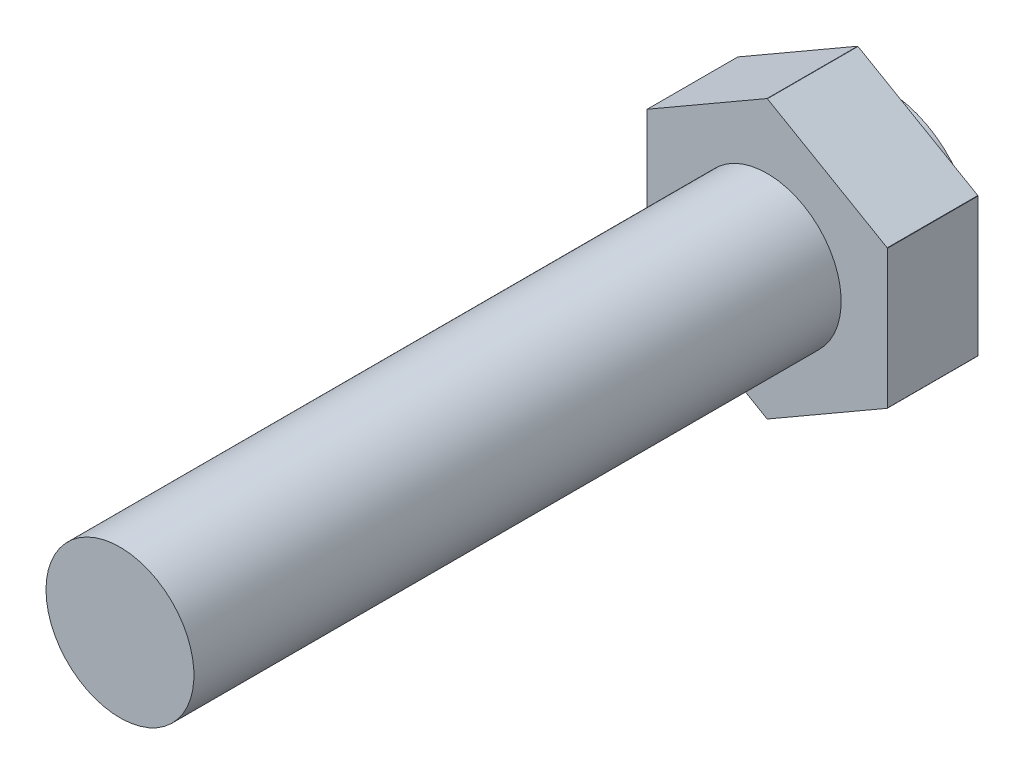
ISO-10303-21;
HEADER;
FILE_DESCRIPTION(('STEP AP214'),'2;1');
FILE_NAME('part.step','',(''),(''),'','','');
FILE_SCHEMA(('AUTOMOTIVE_DESIGN { 1 0 10303 214 1 1 1 1 }'));
ENDSEC;
DATA;
#1=APPLICATION_CONTEXT('core data for automotive mechanical design processes');
#2=APPLICATION_PROTOCOL_DEFINITION('international standard','automotive_design',2000,#1);
#3=PRODUCT_CONTEXT('',#1,'mechanical');
#4=PRODUCT('Part','Part','',(#3));
#5=PRODUCT_RELATED_PRODUCT_CATEGORY('part','',(#4));
#6=PRODUCT_DEFINITION_FORMATION('','',#4);
#7=PRODUCT_DEFINITION_CONTEXT('part definition',#1,'design');
#8=PRODUCT_DEFINITION('design','',#6,#7);
#9=PRODUCT_DEFINITION_SHAPE('','',#8);
#10=(LENGTH_UNIT() NAMED_UNIT(*) SI_UNIT(.MILLI.,.METRE.));
#11=(NAMED_UNIT(*) PLANE_ANGLE_UNIT() SI_UNIT($,.RADIAN.));
#12=(NAMED_UNIT(*) SI_UNIT($,.STERADIAN.) SOLID_ANGLE_UNIT());
#13=UNCERTAINTY_MEASURE_WITH_UNIT(LENGTH_MEASURE(1.E-05),#10,'distance_accuracy_value','');
#14=(GEOMETRIC_REPRESENTATION_CONTEXT(3) GLOBAL_UNCERTAINTY_ASSIGNED_CONTEXT((#13)) GLOBAL_UNIT_ASSIGNED_CONTEXT((#10,
#11,#12)) REPRESENTATION_CONTEXT('',''));
#15=CARTESIAN_POINT('',(0.,0.,0.));
#16=DIRECTION('',(0.,0.,1.));
#17=DIRECTION('',(1.,0.,0.));
#18=AXIS2_PLACEMENT_3D('',#15,#16,#17);
#19=CARTESIAN_POINT('',(-4.,0.,6.4));
#20=DIRECTION('',(0.,0.,-1.));
#21=DIRECTION('',(-1.,0.,0.));
#22=AXIS2_PLACEMENT_3D('',#19,#20,#21);
#23=PLANE('',#22);
#24=CARTESIAN_POINT('',(0.,0.,6.4));
#25=DIRECTION('',(0.,0.,-1.));
#26=DIRECTION('',(-1.,0.,0.));
#27=AXIS2_PLACEMENT_3D('',#24,#25,#26);
#28=CIRCLE('',#27,4.);
#29=CARTESIAN_POINT('',(-4.,0.,6.4));
#30=VERTEX_POINT('',#29);
#31=EDGE_CURVE('E131',#30,#30,#28,.T.);
#32=ORIENTED_EDGE('',*,*,#31,.T.);
#33=EDGE_LOOP('',(#32));
#34=FACE_BOUND('',#33,.T.);
#35=CARTESIAN_POINT('',(0.,0.,6.4));
#36=DIRECTION('',(0.,0.,-1.));
#37=DIRECTION('',(-1.,0.,0.));
#38=AXIS2_PLACEMENT_3D('',#35,#36,#37);
#39=CIRCLE('',#38,7.5);
#40=CARTESIAN_POINT('',(-0.00962965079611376,7.49999381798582,6.4));
#41=VERTEX_POINT('',#40);
#42=CARTESIAN_POINT('',(0.00962965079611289,7.49999381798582,6.4));
#43=VERTEX_POINT('',#42);
#44=EDGE_CURVE('E132',#41,#43,#39,.T.);
#45=ORIENTED_EDGE('',*,*,#44,.F.);
#46=DIRECTION('',(-0.866025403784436,-0.5,0.));
#47=VECTOR('',#46,1.);
#48=CARTESIAN_POINT('',(-6.25,3.89711431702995,6.4));
#49=LINE('',#48,#47);
#50=CARTESIAN_POINT('',(-6.49037034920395,3.75833643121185,6.4));
#51=VERTEX_POINT('',#50);
#52=EDGE_CURVE('E116',#41,#51,#49,.T.);
#53=ORIENTED_EDGE('',*,*,#52,.T.);
#54=CARTESIAN_POINT('',(-6.5,3.74165738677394,6.4));
#55=VERTEX_POINT('',#54);
#56=EDGE_CURVE('E128',#55,#51,#39,.T.);
#57=ORIENTED_EDGE('',*,*,#56,.F.);
#58=DIRECTION('',(0.,-1.,0.));
#59=VECTOR('',#58,1.);
#60=CARTESIAN_POINT('',(-6.5,0.,6.4));
#61=LINE('',#60,#59);
#62=CARTESIAN_POINT('',(-6.5,-3.74165738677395,6.4));
#63=VERTEX_POINT('',#62);
#64=EDGE_CURVE('E122',#55,#63,#61,.T.);
#65=ORIENTED_EDGE('',*,*,#64,.T.);
#66=CARTESIAN_POINT('',(-6.49037034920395,-3.75833643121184,6.4));
#67=VERTEX_POINT('',#66);
#68=EDGE_CURVE('E127',#67,#63,#39,.T.);
#69=ORIENTED_EDGE('',*,*,#68,.F.);
#70=DIRECTION('',(-0.866025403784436,0.5,0.));
#71=VECTOR('',#70,1.);
#72=CARTESIAN_POINT('',(-6.25,-3.89711431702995,6.4));
#73=LINE('',#72,#71);
#74=CARTESIAN_POINT('',(-0.00962965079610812,-7.49999381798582,6.4));
#75=VERTEX_POINT('',#74);
#76=EDGE_CURVE('E248',#75,#67,#73,.T.);
#77=ORIENTED_EDGE('',*,*,#76,.F.);
#78=CARTESIAN_POINT('',(0.00962965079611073,-7.49999381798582,6.4));
#79=VERTEX_POINT('',#78);
#80=EDGE_CURVE('E263',#79,#75,#39,.T.);
#81=ORIENTED_EDGE('',*,*,#80,.F.);
#82=DIRECTION('',(0.866025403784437,0.5,0.));
#83=VECTOR('',#82,1.);
#84=CARTESIAN_POINT('',(0.250000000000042,-7.36121593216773,6.4));
#85=LINE('',#84,#83);
#86=CARTESIAN_POINT('',(6.49037034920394,-3.75833643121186,6.4));
#87=VERTEX_POINT('',#86);
#88=EDGE_CURVE('E240',#79,#87,#85,.T.);
#89=ORIENTED_EDGE('',*,*,#88,.T.);
#90=CARTESIAN_POINT('',(6.5,-3.74165738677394,6.4));
#91=VERTEX_POINT('',#90);
#92=EDGE_CURVE('E265',#91,#87,#39,.T.);
#93=ORIENTED_EDGE('',*,*,#92,.F.);
#94=DIRECTION('',(0.,-1.,0.));
#95=VECTOR('',#94,1.);
#96=CARTESIAN_POINT('',(6.5,0.,6.4));
#97=LINE('',#96,#95);
#98=CARTESIAN_POINT('',(6.5,3.74165738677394,6.4));
#99=VERTEX_POINT('',#98);
#100=EDGE_CURVE('E233',#99,#91,#97,.T.);
#101=ORIENTED_EDGE('',*,*,#100,.F.);
#102=CARTESIAN_POINT('',(6.49037034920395,3.75833643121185,6.4));
#103=VERTEX_POINT('',#102);
#104=EDGE_CURVE('E270',#103,#99,#39,.T.);
#105=ORIENTED_EDGE('',*,*,#104,.F.);
#106=DIRECTION('',(0.866025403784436,-0.5,0.));
#107=VECTOR('',#106,1.);
#108=CARTESIAN_POINT('',(0.250000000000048,7.36121593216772,6.4));
#109=LINE('',#108,#107);
#110=EDGE_CURVE('E226',#43,#103,#109,.T.);
#111=ORIENTED_EDGE('',*,*,#110,.F.);
#112=EDGE_LOOP('',(#45,#53,#57,#65,#69,#77,#81,#89,#93,#101,#105,#111));
#113=FACE_BOUND('',#112,.T.);
#114=ADVANCED_FACE('F15',(#34,#113),#23,.F.);
#115=CARTESIAN_POINT('',(0.,0.,-28.6));
#116=DIRECTION('',(0.,0.,-1.));
#117=DIRECTION('',(-1.,0.,0.));
#118=AXIS2_PLACEMENT_3D('',#115,#116,#117);
#119=CYLINDRICAL_SURFACE('',#118,7.5);
#120=DIRECTION('',(0.,0.,-1.));
#121=VECTOR('',#120,1.);
#122=CARTESIAN_POINT('',(-6.49037034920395,3.75833643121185,-28.6));
#123=LINE('',#122,#121);
#124=CARTESIAN_POINT('',(-6.49037034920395,3.75833643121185,1.5));
#125=VERTEX_POINT('',#124);
#126=EDGE_CURVE('E37',#51,#125,#123,.T.);
#127=ORIENTED_EDGE('',*,*,#126,.T.);
#128=CARTESIAN_POINT('',(0.,0.,1.5));
#129=DIRECTION('',(0.,0.,1.));
#130=DIRECTION('',(1.,0.,0.));
#131=AXIS2_PLACEMENT_3D('',#128,#129,#130);
#132=CIRCLE('',#131,7.5);
#133=CARTESIAN_POINT('',(-6.5,3.74165738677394,1.5));
#134=VERTEX_POINT('',#133);
#135=EDGE_CURVE('E31',#125,#134,#132,.T.);
#136=ORIENTED_EDGE('',*,*,#135,.T.);
#137=DIRECTION('',(0.,0.,-1.));
#138=VECTOR('',#137,1.);
#139=CARTESIAN_POINT('',(-6.5,3.74165738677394,-28.6));
#140=LINE('',#139,#138);
#141=EDGE_CURVE('E253',#134,#55,#140,.F.);
#142=ORIENTED_EDGE('',*,*,#141,.T.);
#143=ORIENTED_EDGE('',*,*,#56,.T.);
#144=EDGE_LOOP('',(#127,#136,#142,#143));
#145=FACE_BOUND('',#144,.T.);
#146=ADVANCED_FACE('F152',(#145),#119,.T.);
#147=DIRECTION('',(0.,0.,-1.));
#148=VECTOR('',#147,1.);
#149=CARTESIAN_POINT('',(-6.5,-3.74165738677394,-28.6));
#150=LINE('',#149,#148);
#151=CARTESIAN_POINT('',(-6.5,-3.74165738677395,1.5));
#152=VERTEX_POINT('',#151);
#153=EDGE_CURVE('E118',#63,#152,#150,.T.);
#154=ORIENTED_EDGE('',*,*,#153,.T.);
#155=CARTESIAN_POINT('',(0.,0.,1.5));
#156=DIRECTION('',(0.,0.,1.));
#157=DIRECTION('',(1.,0.,0.));
#158=AXIS2_PLACEMENT_3D('',#155,#156,#157);
#159=CIRCLE('',#158,7.5);
#160=CARTESIAN_POINT('',(-6.49037034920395,-3.75833643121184,1.5));
#161=VERTEX_POINT('',#160);
#162=EDGE_CURVE('E209',#152,#161,#159,.T.);
#163=ORIENTED_EDGE('',*,*,#162,.T.);
#164=DIRECTION('',(0.,0.,-1.));
#165=VECTOR('',#164,1.);
#166=CARTESIAN_POINT('',(-6.49037034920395,-3.75833643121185,-28.6));
#167=LINE('',#166,#165);
#168=EDGE_CURVE('E250',#67,#161,#167,.T.);
#169=ORIENTED_EDGE('',*,*,#168,.F.);
#170=ORIENTED_EDGE('',*,*,#68,.T.);
#171=EDGE_LOOP('',(#154,#163,#169,#170));
#172=FACE_BOUND('',#171,.T.);
#173=ADVANCED_FACE('F159',(#172),#119,.T.);
#174=DIRECTION('',(0.,0.,-1.));
#175=VECTOR('',#174,1.);
#176=CARTESIAN_POINT('',(0.00962965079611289,7.49999381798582,-28.6));
#177=LINE('',#176,#175);
#178=CARTESIAN_POINT('',(0.00962965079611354,7.49999381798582,1.5));
#179=VERTEX_POINT('',#178);
#180=EDGE_CURVE('E112',#179,#43,#177,.F.);
#181=ORIENTED_EDGE('',*,*,#180,.F.);
#182=CARTESIAN_POINT('',(0.,0.,1.5));
#183=DIRECTION('',(0.,0.,1.));
#184=DIRECTION('',(1.,0.,0.));
#185=AXIS2_PLACEMENT_3D('',#182,#183,#184);
#186=CIRCLE('',#185,7.5);
#187=CARTESIAN_POINT('',(-0.00962965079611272,7.49999381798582,1.5));
#188=VERTEX_POINT('',#187);
#189=EDGE_CURVE('E104',#179,#188,#186,.T.);
#190=ORIENTED_EDGE('',*,*,#189,.T.);
#191=DIRECTION('',(0.,0.,-1.));
#192=VECTOR('',#191,1.);
#193=CARTESIAN_POINT('',(-0.00962965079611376,7.49999381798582,-28.6));
#194=LINE('',#193,#192);
#195=EDGE_CURVE('E111',#188,#41,#194,.F.);
#196=ORIENTED_EDGE('',*,*,#195,.T.);
#197=ORIENTED_EDGE('',*,*,#44,.T.);
#198=EDGE_LOOP('',(#181,#190,#196,#197));
#199=FACE_BOUND('',#198,.T.);
#200=ADVANCED_FACE('F109',(#199),#119,.T.);
#201=DIRECTION('',(0.,0.,-1.));
#202=VECTOR('',#201,1.);
#203=CARTESIAN_POINT('',(-0.00962965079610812,-7.49999381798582,-28.6));
#204=LINE('',#203,#202);
#205=CARTESIAN_POINT('',(-0.00962965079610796,-7.49999381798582,1.5));
#206=VERTEX_POINT('',#205);
#207=EDGE_CURVE('E246',#206,#75,#204,.F.);
#208=ORIENTED_EDGE('',*,*,#207,.F.);
#209=CARTESIAN_POINT('',(0.,0.,1.5));
#210=DIRECTION('',(0.,0.,1.));
#211=DIRECTION('',(1.,0.,0.));
#212=AXIS2_PLACEMENT_3D('',#209,#210,#211);
#213=CIRCLE('',#212,7.5);
#214=CARTESIAN_POINT('',(0.00962965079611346,-7.49999381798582,1.5));
#215=VERTEX_POINT('',#214);
#216=EDGE_CURVE('E219',#206,#215,#213,.T.);
#217=ORIENTED_EDGE('',*,*,#216,.T.);
#218=DIRECTION('',(0.,0.,-1.));
#219=VECTOR('',#218,1.);
#220=CARTESIAN_POINT('',(0.00962965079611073,-7.49999381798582,-28.6));
#221=LINE('',#220,#219);
#222=EDGE_CURVE('E238',#215,#79,#221,.F.);
#223=ORIENTED_EDGE('',*,*,#222,.T.);
#224=ORIENTED_EDGE('',*,*,#80,.T.);
#225=EDGE_LOOP('',(#208,#217,#223,#224));
#226=FACE_BOUND('',#225,.T.);
#227=ADVANCED_FACE('F284',(#226),#119,.T.);
#228=DIRECTION('',(0.,0.,-1.));
#229=VECTOR('',#228,1.);
#230=CARTESIAN_POINT('',(6.49037034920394,-3.75833643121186,-28.6));
#231=LINE('',#230,#229);
#232=CARTESIAN_POINT('',(6.49037034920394,-3.75833643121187,1.5));
#233=VERTEX_POINT('',#232);
#234=EDGE_CURVE('E243',#87,#233,#231,.T.);
#235=ORIENTED_EDGE('',*,*,#234,.T.);
#236=CARTESIAN_POINT('',(0.,0.,1.5));
#237=DIRECTION('',(0.,0.,1.));
#238=DIRECTION('',(1.,0.,0.));
#239=AXIS2_PLACEMENT_3D('',#236,#237,#238);
#240=CIRCLE('',#239,7.5);
#241=CARTESIAN_POINT('',(6.5,-3.74165738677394,1.5));
#242=VERTEX_POINT('',#241);
#243=EDGE_CURVE('E216',#233,#242,#240,.T.);
#244=ORIENTED_EDGE('',*,*,#243,.T.);
#245=DIRECTION('',(0.,0.,-1.));
#246=VECTOR('',#245,1.);
#247=CARTESIAN_POINT('',(6.5,-3.74165738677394,-28.6));
#248=LINE('',#247,#246);
#249=EDGE_CURVE('E235',#91,#242,#248,.T.);
#250=ORIENTED_EDGE('',*,*,#249,.F.);
#251=ORIENTED_EDGE('',*,*,#92,.T.);
#252=EDGE_LOOP('',(#235,#244,#250,#251));
#253=FACE_BOUND('',#252,.T.);
#254=ADVANCED_FACE('F149',(#253),#119,.T.);
#255=DIRECTION('',(0.,0.,-1.));
#256=VECTOR('',#255,1.);
#257=CARTESIAN_POINT('',(6.5,3.74165738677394,-28.6));
#258=LINE('',#257,#256);
#259=CARTESIAN_POINT('',(6.5,3.74165738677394,1.5));
#260=VERTEX_POINT('',#259);
#261=EDGE_CURVE('E231',#260,#99,#258,.F.);
#262=ORIENTED_EDGE('',*,*,#261,.F.);
#263=CARTESIAN_POINT('',(0.,0.,1.5));
#264=DIRECTION('',(0.,0.,1.));
#265=DIRECTION('',(1.,0.,0.));
#266=AXIS2_PLACEMENT_3D('',#263,#264,#265);
#267=CIRCLE('',#266,7.5);
#268=CARTESIAN_POINT('',(6.49037034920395,3.75833643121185,1.5));
#269=VERTEX_POINT('',#268);
#270=EDGE_CURVE('E206',#260,#269,#267,.T.);
#271=ORIENTED_EDGE('',*,*,#270,.T.);
#272=DIRECTION('',(0.,0.,-1.));
#273=VECTOR('',#272,1.);
#274=CARTESIAN_POINT('',(6.49037034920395,3.75833643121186,-28.6));
#275=LINE('',#274,#273);
#276=EDGE_CURVE('E228',#103,#269,#275,.T.);
#277=ORIENTED_EDGE('',*,*,#276,.F.);
#278=ORIENTED_EDGE('',*,*,#104,.T.);
#279=EDGE_LOOP('',(#262,#271,#277,#278));
#280=FACE_BOUND('',#279,.T.);
#281=ADVANCED_FACE('F141',(#280),#119,.T.);
#282=CARTESIAN_POINT('',(0.,0.,41.4));
#283=DIRECTION('',(0.,0.,-1.));
#284=DIRECTION('',(-1.,0.,0.));
#285=AXIS2_PLACEMENT_3D('',#282,#283,#284);
#286=PLANE('',#285);
#287=CARTESIAN_POINT('',(0.,0.,41.4));
#288=DIRECTION('',(0.,0.,-1.));
#289=DIRECTION('',(-1.,0.,0.));
#290=AXIS2_PLACEMENT_3D('',#287,#288,#289);
#291=CIRCLE('',#290,4.);
#292=CARTESIAN_POINT('',(-4.,0.,41.4));
#293=VERTEX_POINT('',#292);
#294=EDGE_CURVE('E24',#293,#293,#291,.T.);
#295=ORIENTED_EDGE('',*,*,#294,.F.);
#296=EDGE_LOOP('',(#295));
#297=FACE_BOUND('',#296,.T.);
#298=ADVANCED_FACE('F17',(#297),#286,.F.);
#299=CARTESIAN_POINT('',(0.,0.,-28.6));
#300=DIRECTION('',(0.,0.,-1.));
#301=DIRECTION('',(-1.,0.,0.));
#302=AXIS2_PLACEMENT_3D('',#299,#300,#301);
#303=CYLINDRICAL_SURFACE('',#302,4.);
#304=ORIENTED_EDGE('',*,*,#31,.F.);
#305=EDGE_LOOP('',(#304));
#306=FACE_BOUND('',#305,.T.);
#307=ORIENTED_EDGE('',*,*,#294,.T.);
#308=EDGE_LOOP('',(#307));
#309=FACE_BOUND('',#308,.T.);
#310=ADVANCED_FACE('F138',(#306,#309),#303,.T.);
#311=CARTESIAN_POINT('',(0.,7.50555349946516,10.));
#312=DIRECTION('',(0.5,0.866025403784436,0.));
#313=DIRECTION('',(0.866025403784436,-0.5,0.));
#314=AXIS2_PLACEMENT_3D('',#311,#312,#313);
#315=PLANE('',#314);
#316=DIRECTION('',(0.866025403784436,-0.5,0.));
#317=VECTOR('',#316,1.);
#318=CARTESIAN_POINT('',(0.,7.50555349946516,1.5));
#319=LINE('',#318,#317);
#320=EDGE_CURVE('E204',#179,#269,#319,.T.);
#321=ORIENTED_EDGE('',*,*,#320,.F.);
#322=ORIENTED_EDGE('',*,*,#180,.T.);
#323=ORIENTED_EDGE('',*,*,#110,.T.);
#324=ORIENTED_EDGE('',*,*,#276,.T.);
#325=EDGE_LOOP('',(#321,#322,#323,#324));
#326=FACE_BOUND('',#325,.T.);
#327=ADVANCED_FACE('F147',(#326),#315,.T.);
#328=CARTESIAN_POINT('',(6.5,3.75277674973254,10.));
#329=DIRECTION('',(1.,0.,0.));
#330=DIRECTION('',(0.,0.,-1.));
#331=AXIS2_PLACEMENT_3D('',#328,#329,#330);
#332=PLANE('',#331);
#333=DIRECTION('',(0.,-1.,0.));
#334=VECTOR('',#333,1.);
#335=CARTESIAN_POINT('',(6.5,3.75277674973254,1.5));
#336=LINE('',#335,#334);
#337=EDGE_CURVE('E214',#260,#242,#336,.T.);
#338=ORIENTED_EDGE('',*,*,#337,.F.);
#339=ORIENTED_EDGE('',*,*,#261,.T.);
#340=ORIENTED_EDGE('',*,*,#100,.T.);
#341=ORIENTED_EDGE('',*,*,#249,.T.);
#342=EDGE_LOOP('',(#338,#339,#340,#341));
#343=FACE_BOUND('',#342,.T.);
#344=ADVANCED_FACE('F178',(#343),#332,.T.);
#345=CARTESIAN_POINT('',(0.,-7.50555349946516,10.));
#346=DIRECTION('',(-0.5,0.866025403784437,0.));
#347=DIRECTION('',(0.866025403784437,0.5,0.));
#348=AXIS2_PLACEMENT_3D('',#345,#346,#347);
#349=PLANE('',#348);
#350=ORIENTED_EDGE('',*,*,#222,.F.);
#351=DIRECTION('',(0.866025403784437,0.5,0.));
#352=VECTOR('',#351,1.);
#353=CARTESIAN_POINT('',(0.,-7.50555349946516,1.5));
#354=LINE('',#353,#352);
#355=EDGE_CURVE('E222',#215,#233,#354,.T.);
#356=ORIENTED_EDGE('',*,*,#355,.T.);
#357=ORIENTED_EDGE('',*,*,#234,.F.);
#358=ORIENTED_EDGE('',*,*,#88,.F.);
#359=EDGE_LOOP('',(#350,#356,#357,#358));
#360=FACE_BOUND('',#359,.T.);
#361=ADVANCED_FACE('F174',(#360),#349,.F.);
#362=CARTESIAN_POINT('',(0.,-7.50555349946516,10.));
#363=DIRECTION('',(-0.5,-0.866025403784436,0.));
#364=DIRECTION('',(-0.866025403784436,0.5,0.));
#365=AXIS2_PLACEMENT_3D('',#362,#363,#364);
#366=PLANE('',#365);
#367=DIRECTION('',(-0.866025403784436,0.5,0.));
#368=VECTOR('',#367,1.);
#369=CARTESIAN_POINT('',(0.,-7.50555349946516,1.5));
#370=LINE('',#369,#368);
#371=EDGE_CURVE('E212',#206,#161,#370,.T.);
#372=ORIENTED_EDGE('',*,*,#371,.F.);
#373=ORIENTED_EDGE('',*,*,#207,.T.);
#374=ORIENTED_EDGE('',*,*,#76,.T.);
#375=ORIENTED_EDGE('',*,*,#168,.T.);
#376=EDGE_LOOP('',(#372,#373,#374,#375));
#377=FACE_BOUND('',#376,.T.);
#378=ADVANCED_FACE('F170',(#377),#366,.T.);
#379=CARTESIAN_POINT('',(-6.5,3.75277674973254,10.));
#380=DIRECTION('',(1.,0.,0.));
#381=DIRECTION('',(0.,-1.,0.));
#382=AXIS2_PLACEMENT_3D('',#379,#380,#381);
#383=PLANE('',#382);
#384=ORIENTED_EDGE('',*,*,#141,.F.);
#385=DIRECTION('',(0.,-1.,0.));
#386=VECTOR('',#385,1.);
#387=CARTESIAN_POINT('',(-6.5,3.75277674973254,1.5));
#388=LINE('',#387,#386);
#389=EDGE_CURVE('E201',#134,#152,#388,.T.);
#390=ORIENTED_EDGE('',*,*,#389,.T.);
#391=ORIENTED_EDGE('',*,*,#153,.F.);
#392=ORIENTED_EDGE('',*,*,#64,.F.);
#393=EDGE_LOOP('',(#384,#390,#391,#392));
#394=FACE_BOUND('',#393,.T.);
#395=ADVANCED_FACE('F167',(#394),#383,.F.);
#396=CARTESIAN_POINT('',(0.,7.50555349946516,10.));
#397=DIRECTION('',(0.5,-0.866025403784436,0.));
#398=DIRECTION('',(-0.866025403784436,-0.5,0.));
#399=AXIS2_PLACEMENT_3D('',#396,#397,#398);
#400=PLANE('',#399);
#401=ORIENTED_EDGE('',*,*,#195,.F.);
#402=DIRECTION('',(-0.866025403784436,-0.5,0.));
#403=VECTOR('',#402,1.);
#404=CARTESIAN_POINT('',(0.,7.50555349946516,1.5));
#405=LINE('',#404,#403);
#406=EDGE_CURVE('E9',#188,#125,#405,.T.);
#407=ORIENTED_EDGE('',*,*,#406,.T.);
#408=ORIENTED_EDGE('',*,*,#126,.F.);
#409=ORIENTED_EDGE('',*,*,#52,.F.);
#410=EDGE_LOOP('',(#401,#407,#408,#409));
#411=FACE_BOUND('',#410,.T.);
#412=ADVANCED_FACE('F115',(#411),#400,.F.);
#413=CARTESIAN_POINT('',(0.,0.,1.4));
#414=DIRECTION('',(0.,0.,-1.));
#415=DIRECTION('',(-1.,0.,0.));
#416=AXIS2_PLACEMENT_3D('',#413,#414,#415);
#417=CYLINDRICAL_SURFACE('',#416,4.75);
#418=CARTESIAN_POINT('',(0.,0.,1.5));
#419=DIRECTION('',(0.,0.,-1.));
#420=DIRECTION('',(-1.,0.,0.));
#421=AXIS2_PLACEMENT_3D('',#418,#419,#420);
#422=CIRCLE('',#421,4.75);
#423=CARTESIAN_POINT('',(-4.75,0.,1.5));
#424=VERTEX_POINT('',#423);
#425=EDGE_CURVE('E113',#424,#424,#422,.T.);
#426=ORIENTED_EDGE('',*,*,#425,.T.);
#427=EDGE_LOOP('',(#426));
#428=FACE_BOUND('',#427,.T.);
#429=CARTESIAN_POINT('',(0.,0.,0.));
#430=DIRECTION('',(0.,0.,1.));
#431=DIRECTION('',(1.,0.,0.));
#432=AXIS2_PLACEMENT_3D('',#429,#430,#431);
#433=CIRCLE('',#432,4.75);
#434=CARTESIAN_POINT('',(4.75,0.,0.));
#435=VERTEX_POINT('',#434);
#436=EDGE_CURVE('E19',#435,#435,#433,.T.);
#437=ORIENTED_EDGE('',*,*,#436,.T.);
#438=EDGE_LOOP('',(#437));
#439=FACE_BOUND('',#438,.T.);
#440=ADVANCED_FACE('F188',(#428,#439),#417,.T.);
#441=CARTESIAN_POINT('',(0.,11.4999999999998,1.5));
#442=DIRECTION('',(0.,0.,1.));
#443=DIRECTION('',(1.,0.,0.));
#444=AXIS2_PLACEMENT_3D('',#441,#442,#443);
#445=PLANE('',#444);
#446=ORIENTED_EDGE('',*,*,#425,.F.);
#447=EDGE_LOOP('',(#446));
#448=FACE_BOUND('',#447,.T.);
#449=ORIENTED_EDGE('',*,*,#216,.F.);
#450=ORIENTED_EDGE('',*,*,#371,.T.);
#451=ORIENTED_EDGE('',*,*,#162,.F.);
#452=ORIENTED_EDGE('',*,*,#389,.F.);
#453=ORIENTED_EDGE('',*,*,#135,.F.);
#454=ORIENTED_EDGE('',*,*,#406,.F.);
#455=ORIENTED_EDGE('',*,*,#189,.F.);
#456=ORIENTED_EDGE('',*,*,#320,.T.);
#457=ORIENTED_EDGE('',*,*,#270,.F.);
#458=ORIENTED_EDGE('',*,*,#337,.T.);
#459=ORIENTED_EDGE('',*,*,#243,.F.);
#460=ORIENTED_EDGE('',*,*,#355,.F.);
#461=EDGE_LOOP('',(#449,#450,#451,#452,#453,#454,#455,#456,#457,#458,#459,#460));
#462=FACE_BOUND('',#461,.T.);
#463=ADVANCED_FACE('F103',(#448,#462),#445,.F.);
#464=CARTESIAN_POINT('',(-7.5,0.,0.));
#465=DIRECTION('',(0.,0.,1.));
#466=DIRECTION('',(1.,0.,0.));
#467=AXIS2_PLACEMENT_3D('',#464,#465,#466);
#468=PLANE('',#467);
#469=ORIENTED_EDGE('',*,*,#436,.F.);
#470=EDGE_LOOP('',(#469));
#471=FACE_BOUND('',#470,.T.);
#472=ADVANCED_FACE('F163',(#471),#468,.F.);
#473=CLOSED_SHELL('',(#114,#146,#173,#200,#227,#254,#281,#298,#310,#327,#344,#361,#378,#395,
#412,#440,#463,#472));
#474=MANIFOLD_SOLID_BREP('B1',#473);
#475=ADVANCED_BREP_SHAPE_REPRESENTATION('',(#18,#474),#14);
#476=SHAPE_DEFINITION_REPRESENTATION(#9,#475);
ENDSEC;
END-ISO-10303-21;
